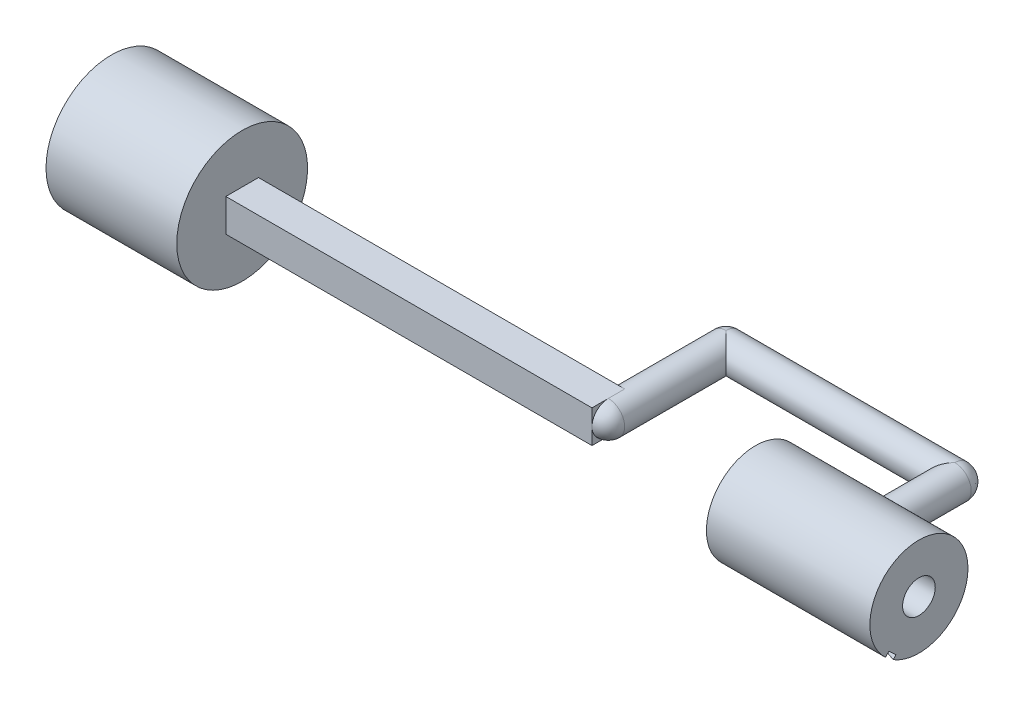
ISO-10303-21;
HEADER;
FILE_DESCRIPTION(('STEP AP214'),'2;1');
FILE_NAME('part.step','',(''),(''),'','','');
FILE_SCHEMA(('AUTOMOTIVE_DESIGN { 1 0 10303 214 1 1 1 1 }'));
ENDSEC;
DATA;
#1=APPLICATION_CONTEXT('core data for automotive mechanical design processes');
#2=APPLICATION_PROTOCOL_DEFINITION('international standard','automotive_design',2000,#1);
#3=PRODUCT_CONTEXT('',#1,'mechanical');
#4=PRODUCT('Part','Part','',(#3));
#5=PRODUCT_RELATED_PRODUCT_CATEGORY('part','',(#4));
#6=PRODUCT_DEFINITION_FORMATION('','',#4);
#7=PRODUCT_DEFINITION_CONTEXT('part definition',#1,'design');
#8=PRODUCT_DEFINITION('design','',#6,#7);
#9=PRODUCT_DEFINITION_SHAPE('','',#8);
#10=(LENGTH_UNIT() NAMED_UNIT(*) SI_UNIT(.MILLI.,.METRE.));
#11=(NAMED_UNIT(*) PLANE_ANGLE_UNIT() SI_UNIT($,.RADIAN.));
#12=(NAMED_UNIT(*) SI_UNIT($,.STERADIAN.) SOLID_ANGLE_UNIT());
#13=UNCERTAINTY_MEASURE_WITH_UNIT(LENGTH_MEASURE(1.E-05),#10,'distance_accuracy_value','');
#14=(GEOMETRIC_REPRESENTATION_CONTEXT(3) GLOBAL_UNCERTAINTY_ASSIGNED_CONTEXT((#13)) GLOBAL_UNIT_ASSIGNED_CONTEXT((#10,
#11,#12)) REPRESENTATION_CONTEXT('',''));
#15=CARTESIAN_POINT('',(0.,0.,0.));
#16=DIRECTION('',(0.,0.,1.));
#17=DIRECTION('',(1.,0.,0.));
#18=AXIS2_PLACEMENT_3D('',#15,#16,#17);
#19=CARTESIAN_POINT('',(12.5,0.,18.));
#20=DIRECTION('',(-1.,0.,0.));
#21=DIRECTION('',(0.,0.,1.));
#22=AXIS2_PLACEMENT_3D('',#19,#20,#21);
#23=CYLINDRICAL_SURFACE('',#22,7.5);
#24=CARTESIAN_POINT('',(-2.5,0.,10.5));
#25=CARTESIAN_POINT('',(-2.5000006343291,-0.136408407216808,10.4999996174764));
#26=CARTESIAN_POINT('',(-2.48879933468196,-0.272812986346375,10.5037557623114));
#27=CARTESIAN_POINT('',(-2.44442722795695,-0.541604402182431,10.518369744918));
#28=CARTESIAN_POINT('',(-2.41125414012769,-0.673990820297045,10.5292283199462));
#29=CARTESIAN_POINT('',(-2.32420189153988,-0.93083197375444,10.5568673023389));
#30=CARTESIAN_POINT('',(-2.27035734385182,-1.05529956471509,10.5736378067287));
#31=CARTESIAN_POINT('',(-2.14364706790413,-1.29343734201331,10.6113888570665));
#32=CARTESIAN_POINT('',(-2.0707775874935,-1.40710539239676,10.6323702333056));
#33=CARTESIAN_POINT('',(-1.90543548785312,-1.62435418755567,10.6771476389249));
#34=CARTESIAN_POINT('',(-1.81242191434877,-1.72750925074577,10.7010110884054));
#35=CARTESIAN_POINT('',(-1.61058211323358,-1.91708173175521,10.748492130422));
#36=CARTESIAN_POINT('',(-1.50175241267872,-2.00349546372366,10.7721096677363));
#37=CARTESIAN_POINT('',(-1.26753721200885,-2.15956235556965,10.8171666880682));
#38=CARTESIAN_POINT('',(-1.14176565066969,-2.22866214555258,10.8385240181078));
#39=CARTESIAN_POINT('',(-0.879559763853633,-2.3445471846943,10.875617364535));
#40=CARTESIAN_POINT('',(-0.74312870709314,-2.39133924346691,10.8913550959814));
#41=CARTESIAN_POINT('',(-0.468316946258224,-2.45968365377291,10.9147174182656));
#42=CARTESIAN_POINT('',(-0.330156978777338,-2.48203362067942,10.9225976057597));
#43=CARTESIAN_POINT('',(-0.0518406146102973,-2.50335280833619,10.9301085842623));
#44=CARTESIAN_POINT('',(0.0883151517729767,-2.5023292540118,10.9297419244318));
#45=CARTESIAN_POINT('',(0.359841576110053,-2.47754975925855,10.9210246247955));
#46=CARTESIAN_POINT('',(0.491321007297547,-2.45483478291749,10.9130396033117));
#47=CARTESIAN_POINT('',(0.748483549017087,-2.38901540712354,10.8905835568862));
#48=CARTESIAN_POINT('',(0.874165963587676,-2.34590856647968,10.8761117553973));
#49=CARTESIAN_POINT('',(1.1185318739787,-2.23984764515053,10.8420522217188));
#50=CARTESIAN_POINT('',(1.23707006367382,-2.17658512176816,10.8223858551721));
#51=CARTESIAN_POINT('',(1.46217727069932,-2.03222276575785,10.7801860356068));
#52=CARTESIAN_POINT('',(1.56874281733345,-1.95111778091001,10.7576517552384));
#53=CARTESIAN_POINT('',(1.77272899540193,-1.76837333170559,10.7108167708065));
#54=CARTESIAN_POINT('',(1.86938173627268,-1.66588287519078,10.6864852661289));
#55=CARTESIAN_POINT('',(2.0443281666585,-1.44584892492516,10.6398265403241));
#56=CARTESIAN_POINT('',(2.12262009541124,-1.32830398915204,10.6174995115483));
#57=CARTESIAN_POINT('',(2.25924075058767,-1.07986903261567,10.5770723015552));
#58=CARTESIAN_POINT('',(2.31736372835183,-0.94885819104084,10.559016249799));
#59=CARTESIAN_POINT('',(2.41050793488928,-0.678172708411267,10.5294858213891));
#60=CARTESIAN_POINT('',(2.44553718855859,-0.538501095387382,10.518009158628));
#61=CARTESIAN_POINT('',(2.4901391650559,-0.260959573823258,10.503309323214));
#62=CARTESIAN_POINT('',(2.50074952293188,-0.123273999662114,10.4997499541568));
#63=CARTESIAN_POINT('',(2.49916831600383,0.151937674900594,10.5002774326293));
#64=CARTESIAN_POINT('',(2.48698060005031,0.289463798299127,10.5043629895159));
#65=CARTESIAN_POINT('',(2.4409702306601,0.55629966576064,10.5194993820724));
#66=CARTESIAN_POINT('',(2.40778448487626,0.68573201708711,10.5303450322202));
#67=CARTESIAN_POINT('',(2.32151638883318,0.937139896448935,10.5577038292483));
#68=CARTESIAN_POINT('',(2.26843150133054,1.05911447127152,10.5742176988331));
#69=CARTESIAN_POINT('',(2.14232392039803,1.29572074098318,10.6117767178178));
#70=CARTESIAN_POINT('',(2.06881351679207,1.41007489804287,10.6329296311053));
#71=CARTESIAN_POINT('',(1.90451462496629,1.62516207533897,10.6773686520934));
#72=CARTESIAN_POINT('',(1.81372085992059,1.72589091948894,10.7006554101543));
#73=CARTESIAN_POINT('',(1.61255312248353,1.91563126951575,10.7480788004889));
#74=CARTESIAN_POINT('',(1.50147693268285,2.00390242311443,10.7722059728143));
#75=CARTESIAN_POINT('',(1.26557108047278,2.16064380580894,10.8175006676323));
#76=CARTESIAN_POINT('',(1.14074130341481,2.22911386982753,10.8386681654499));
#77=CARTESIAN_POINT('',(0.880817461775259,2.3439923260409,10.8754402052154));
#78=CARTESIAN_POINT('',(0.745744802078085,2.39044533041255,10.8910559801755));
#79=CARTESIAN_POINT('',(0.469053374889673,2.45973666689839,10.9147291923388));
#80=CARTESIAN_POINT('',(0.327437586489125,2.48258563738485,10.922790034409));
#81=CARTESIAN_POINT('',(0.0495072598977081,2.50319070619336,10.9300535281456));
#82=CARTESIAN_POINT('',(-0.0867058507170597,2.502175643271,10.9296899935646));
#83=CARTESIAN_POINT('',(-0.356912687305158,2.47810573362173,10.9212182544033));
#84=CARTESIAN_POINT('',(-0.490906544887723,2.45505219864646,10.913110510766));
#85=CARTESIAN_POINT('',(-0.750339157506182,2.38842953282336,10.8903868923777));
#86=CARTESIAN_POINT('',(-0.875892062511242,2.34525836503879,10.8758975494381));
#87=CARTESIAN_POINT('',(-1.11806851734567,2.23994841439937,10.8420900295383));
#88=CARTESIAN_POINT('',(-1.23469007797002,2.17780542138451,10.8227707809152));
#89=CARTESIAN_POINT('',(-1.46120917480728,2.03315173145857,10.7804292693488));
#90=CARTESIAN_POINT('',(-1.57059125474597,1.94987060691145,10.7572822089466));
#91=CARTESIAN_POINT('',(-1.7742245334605,1.76660720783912,10.7104160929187));
#92=CARTESIAN_POINT('',(-1.86847143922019,1.6666202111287,10.6866968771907));
#93=CARTESIAN_POINT('',(-2.04286103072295,1.44810389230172,10.6402492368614));
#94=CARTESIAN_POINT('',(-2.1223108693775,1.32900378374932,10.6175954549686));
#95=CARTESIAN_POINT('',(-2.25997607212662,1.07839339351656,10.5768502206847));
#96=CARTESIAN_POINT('',(-2.31819686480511,0.94688629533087,10.5587576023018));
#97=CARTESIAN_POINT('',(-2.40930408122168,0.681234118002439,10.5298621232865));
#98=CARTESIAN_POINT('',(-2.44320616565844,0.547469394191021,10.5187696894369));
#99=CARTESIAN_POINT('',(-2.48855070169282,0.275801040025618,10.5038398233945));
#100=CARTESIAN_POINT('',(-2.49999935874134,0.137898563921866,10.5000003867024));
#101=CARTESIAN_POINT('',(-2.5,0.,10.5));
#102=B_SPLINE_CURVE_WITH_KNOTS('',3,(#24,#25,#26,#27,#28,#29,#30,#31,#32,#33,#34,#35,#36,#37,
#38,#39,#40,#41,#42,#43,#44,#45,#46,#47,#48,#49,#50,#51,#52,#53,#54,#55,#56,#57,#58,#59,#60,#61,
#62,#63,#64,#65,#66,#67,#68,#69,#70,#71,#72,#73,#74,#75,#76,#77,#78,#79,#80,#81,#82,#83,#84,#85,
#86,#87,#88,#89,#90,#91,#92,#93,#94,#95,#96,#97,#98,#99,#100,#101),.UNSPECIFIED.,.T.,.F.,(4,2,2,
2,2,2,2,2,2,2,2,2,2,2,2,2,2,2,2,2,2,2,2,2,2,2,2,2,2,2,2,2,2,2,2,2,2,2,4),(0.,0.408717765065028,
0.817477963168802,1.22555668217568,1.63371594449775,2.0546171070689,2.47561083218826,
2.90870962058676,3.34167611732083,3.760048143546,4.17829084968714,4.57742066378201,
4.97659827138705,5.38220427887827,5.78792756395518,6.21483264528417,6.64177864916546,
7.07296014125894,7.50399172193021,7.91633957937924,8.32861782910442,8.72895394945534,
9.1293411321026,9.54025999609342,9.95130452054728,10.3810255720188,10.8107502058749,
11.2396003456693,11.668257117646,12.0748916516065,12.4815019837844,12.8803896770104,
13.2793659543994,13.6957516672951,14.1122552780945,14.5449915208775,14.9776170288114,
15.3909139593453,15.8040966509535),.UNSPECIFIED.);
#103=CARTESIAN_POINT('',(-2.5,0.,10.5));
#104=VERTEX_POINT('',#103);
#105=EDGE_CURVE('E145',#104,#104,#102,.T.);
#106=ORIENTED_EDGE('',*,*,#105,.T.);
#107=EDGE_LOOP('',(#106));
#108=FACE_BOUND('',#107,.T.);
#109=CARTESIAN_POINT('',(12.5,-5.48515276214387,23.1149877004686));
#110=CARTESIAN_POINT('',(9.67857142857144,-6.65261532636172,21.8630373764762));
#111=CARTESIAN_POINT('',(6.85714285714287,-7.16126186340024,20.228526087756));
#112=CARTESIAN_POINT('',(4.03571428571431,-7.66990840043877,18.5940147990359));
#113=CARTESIAN_POINT('',(1.21428571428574,-7.4189952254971,16.9006775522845));
#114=CARTESIAN_POINT('',(-1.60714285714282,-7.16808205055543,15.2073403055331));
#115=CARTESIAN_POINT('',(-4.42857142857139,-6.20730559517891,13.7905633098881));
#116=CARTESIAN_POINT('',(-7.24999999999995,-5.24652913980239,12.373786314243));
#117=CARTESIAN_POINT('',(-10.0714285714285,-3.76618296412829,11.5141796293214));
#118=CARTESIAN_POINT('',(-12.8928571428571,-2.28583678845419,10.6545729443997));
#119=CARTESIAN_POINT('',(-15.7142857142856,-0.579121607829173,10.5223922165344));
#120=CARTESIAN_POINT('',(-18.5357142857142,1.12759357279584,10.3902114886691));
#121=CARTESIAN_POINT('',(-21.3571428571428,2.72264188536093,11.011636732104));
#122=CARTESIAN_POINT('',(-24.1785714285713,4.31769019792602,11.6330619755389));
#123=CARTESIAN_POINT('',(-26.9999999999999,5.48515276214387,12.8850122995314));
#124=CARTESIAN_POINT('',(-29.8214285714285,6.65261532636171,14.1369626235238));
#125=CARTESIAN_POINT('',(-32.642857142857,7.16126186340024,15.771473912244));
#126=(BOUNDED_CURVE() B_SPLINE_CURVE(2,(#109,#110,#111,#112,#113,#114,#115,#116,#117,#118,#119,
#120,#121,#122,#123,#124,#125),.UNSPECIFIED.,.F.,.F.) B_SPLINE_CURVE_WITH_KNOTS((3,2,2,2,2,2,2,
2,3),(0.,0.125,0.25,0.375,0.5,0.625,0.75,0.875,1.),
.UNSPECIFIED.) CURVE() GEOMETRIC_REPRESENTATION_ITEM() RATIONAL_B_SPLINE_CURVE((1.,
0.974927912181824,1.,0.974927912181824,1.,0.974927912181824,1.,0.974927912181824,1.,
0.974927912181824,1.,0.974927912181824,1.,0.974927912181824,1.,0.974927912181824,1.)) REPRESENTATION_ITEM(''));
#127=CARTESIAN_POINT('',(12.5,-5.48515276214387,23.1149877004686));
#128=VERTEX_POINT('',#127);
#129=CARTESIAN_POINT('',(-12.5000173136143,-2.44928880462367,10.9112071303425));
#130=VERTEX_POINT('',#129);
#131=EDGE_CURVE('E52',#128,#130,#126,.T.);
#132=ORIENTED_EDGE('',*,*,#131,.F.);
#133=CARTESIAN_POINT('',(12.5,0.,18.));
#134=DIRECTION('',(1.,0.,0.));
#135=DIRECTION('',(0.,0.,-1.));
#136=AXIS2_PLACEMENT_3D('',#133,#134,#135);
#137=CIRCLE('',#136,7.5);
#138=CARTESIAN_POINT('',(12.5,-6.38825116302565,21.9294079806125));
#139=VERTEX_POINT('',#138);
#140=EDGE_CURVE('E135',#139,#128,#137,.T.);
#141=ORIENTED_EDGE('',*,*,#140,.F.);
#142=CARTESIAN_POINT('',(12.5,-6.38825116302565,21.9294079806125));
#143=CARTESIAN_POINT('',(9.67857142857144,-7.28511289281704,20.4713313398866));
#144=CARTESIAN_POINT('',(6.85714285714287,-7.46052164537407,18.7685159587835));
#145=CARTESIAN_POINT('',(4.03571428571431,-7.6359303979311,17.0657005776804));
#146=CARTESIAN_POINT('',(1.21428571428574,-7.05514431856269,15.4554099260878));
#147=CARTESIAN_POINT('',(-1.60714285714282,-6.47435823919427,13.8451192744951));
#148=CARTESIAN_POINT('',(-4.42857142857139,-5.25240913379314,12.6462911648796));
#149=CARTESIAN_POINT('',(-7.24999999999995,-4.03046002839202,11.4474630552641));
#150=CARTESIAN_POINT('',(-10.0714285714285,-2.40936990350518,10.897540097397));
#151=CARTESIAN_POINT('',(-12.8928571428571,-0.78827977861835,10.3476171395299));
#152=CARTESIAN_POINT('',(-15.7142857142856,0.91087458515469,10.5555183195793));
#153=CARTESIAN_POINT('',(-18.5357142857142,2.61002894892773,10.7634194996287));
#154=CARTESIAN_POINT('',(-21.3571428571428,4.050709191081,11.6879674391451));
#155=CARTESIAN_POINT('',(-24.1785714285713,5.49138943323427,12.6125153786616));
#156=CARTESIAN_POINT('',(-26.9999999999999,6.38825116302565,14.0705920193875));
#157=CARTESIAN_POINT('',(-29.8214285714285,7.28511289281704,15.5286686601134));
#158=CARTESIAN_POINT('',(-32.642857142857,7.46052164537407,17.2314840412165));
#159=(BOUNDED_CURVE() B_SPLINE_CURVE(2,(#142,#143,#144,#145,#146,#147,#148,#149,#150,#151,#152,
#153,#154,#155,#156,#157,#158),.UNSPECIFIED.,.F.,.F.) B_SPLINE_CURVE_WITH_KNOTS((3,2,2,2,2,2,2,
2,3),(0.,0.125,0.25,0.375,0.5,0.625,0.75,0.875,1.),
.UNSPECIFIED.) CURVE() GEOMETRIC_REPRESENTATION_ITEM() RATIONAL_B_SPLINE_CURVE((1.,
0.974927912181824,1.,0.974927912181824,1.,0.974927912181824,1.,0.974927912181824,1.,
0.974927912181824,1.,0.974927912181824,1.,0.974927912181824,1.,0.974927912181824,1.)) REPRESENTATION_ITEM(''));
#160=CARTESIAN_POINT('',(-12.5000000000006,-0.999303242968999,10.5668719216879));
#161=VERTEX_POINT('',#160);
#162=EDGE_CURVE('E138',#139,#161,#159,.T.);
#163=ORIENTED_EDGE('',*,*,#162,.T.);
#164=CARTESIAN_POINT('',(-12.5,0.,18.));
#165=DIRECTION('',(1.,0.,0.));
#166=DIRECTION('',(0.,0.,-1.));
#167=AXIS2_PLACEMENT_3D('',#164,#165,#166);
#168=CIRCLE('',#167,7.5);
#169=EDGE_CURVE('E137',#161,#130,#168,.T.);
#170=ORIENTED_EDGE('',*,*,#169,.T.);
#171=EDGE_LOOP('',(#132,#141,#163,#170));
#172=FACE_BOUND('',#171,.T.);
#173=ADVANCED_FACE('F32',(#108,#172),#23,.T.);
#174=CARTESIAN_POINT('',(-12.5,0.,18.));
#175=DIRECTION('',(1.,0.,0.));
#176=DIRECTION('',(0.,0.,-1.));
#177=AXIS2_PLACEMENT_3D('',#174,#175,#176);
#178=PLANE('',#177);
#179=CARTESIAN_POINT('',(-12.5,0.,18.));
#180=DIRECTION('',(1.,0.,0.));
#181=DIRECTION('',(0.,0.,-1.));
#182=AXIS2_PLACEMENT_3D('',#179,#180,#181);
#183=CIRCLE('',#182,2.5);
#184=CARTESIAN_POINT('',(-12.5,0.,15.5));
#185=VERTEX_POINT('',#184);
#186=EDGE_CURVE('E177',#185,#185,#183,.F.);
#187=ORIENTED_EDGE('',*,*,#186,.F.);
#188=EDGE_LOOP('',(#187));
#189=FACE_BOUND('',#188,.T.);
#190=CARTESIAN_POINT('',(-12.5,-0.799127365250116,11.1462123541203));
#191=CARTESIAN_POINT('',(-12.5,-0.816237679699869,11.0966924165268));
#192=CARTESIAN_POINT('',(-12.5,-0.833347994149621,11.0471724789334));
#193=CARTESIAN_POINT('',(-12.5,-0.867568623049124,10.9481326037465));
#194=CARTESIAN_POINT('',(-12.5,-0.884678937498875,10.898612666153));
#195=CARTESIAN_POINT('',(-12.5,-0.934293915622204,10.755019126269));
#196=CARTESIAN_POINT('',(-12.5,-0.966798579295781,10.6609455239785));
#197=CARTESIAN_POINT('',(-12.5,-0.999303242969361,10.566871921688));
#198=B_SPLINE_CURVE_WITH_KNOTS('',3,(#190,#191,#192,#193,#194,#195,#196,#197),.UNSPECIFIED.,.F.,
.F.,(4,2,2,4),(0.,0.157177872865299,0.314355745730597,0.612948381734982),.UNSPECIFIED.);
#199=CARTESIAN_POINT('',(-12.5,-0.799127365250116,11.1462123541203));
#200=VERTEX_POINT('',#199);
#201=EDGE_CURVE('E11',#200,#161,#198,.T.);
#202=ORIENTED_EDGE('',*,*,#201,.F.);
#203=CARTESIAN_POINT('',(-12.5,-2.20080480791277,11.6305251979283));
#204=CARTESIAN_POINT('',(-12.5,-2.08099445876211,11.5891278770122));
#205=CARTESIAN_POINT('',(-12.5,-1.96118410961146,11.5477305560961));
#206=CARTESIAN_POINT('',(-12.5,-1.72156341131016,11.4649359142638));
#207=CARTESIAN_POINT('',(-12.5,-1.6017530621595,11.4235385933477));
#208=CARTESIAN_POINT('',(-12.5,-1.25433759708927,11.3034982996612));
#209=CARTESIAN_POINT('',(-12.5,-1.0267324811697,11.2248553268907));
#210=CARTESIAN_POINT('',(-12.5,-0.799127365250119,11.1462123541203));
#211=B_SPLINE_CURVE_WITH_KNOTS('',3,(#203,#204,#205,#206,#207,#208,#209,#210),.UNSPECIFIED.,.F.,
.F.,(4,2,2,4),(0.,0.380281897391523,0.760563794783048,1.48298974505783),.UNSPECIFIED.);
#212=CARTESIAN_POINT('',(-12.5,-2.20080480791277,11.6305251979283));
#213=VERTEX_POINT('',#212);
#214=EDGE_CURVE('E44',#213,#200,#211,.T.);
#215=ORIENTED_EDGE('',*,*,#214,.F.);
#216=CARTESIAN_POINT('',(-12.5,-2.44934015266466,10.9112248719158));
#217=CARTESIAN_POINT('',(-12.5,-2.42809624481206,10.9727080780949));
#218=CARTESIAN_POINT('',(-12.5,-2.40685233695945,11.0341912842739));
#219=CARTESIAN_POINT('',(-12.5,-2.36436452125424,11.157157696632));
#220=CARTESIAN_POINT('',(-12.5,-2.34312061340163,11.218640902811));
#221=CARTESIAN_POINT('',(-12.5,-2.28151940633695,11.3969244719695));
#222=CARTESIAN_POINT('',(-12.5,-2.24116210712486,11.5137248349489));
#223=CARTESIAN_POINT('',(-12.5,-2.20080480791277,11.6305251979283));
#224=B_SPLINE_CURVE_WITH_KNOTS('',3,(#216,#217,#218,#219,#220,#221,#222,#223),.UNSPECIFIED.,.F.,
.F.,(4,2,2,4),(0.,0.195149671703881,0.390299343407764,0.761027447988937),.UNSPECIFIED.);
#225=EDGE_CURVE('E272',#130,#213,#224,.T.);
#226=ORIENTED_EDGE('',*,*,#225,.F.);
#227=ORIENTED_EDGE('',*,*,#169,.F.);
#228=EDGE_LOOP('',(#202,#215,#226,#227));
#229=FACE_BOUND('',#228,.T.);
#230=ADVANCED_FACE('F246',(#189,#229),#178,.F.);
#231=CARTESIAN_POINT('',(-35.,-2.5,15.5));
#232=DIRECTION('',(-1.,0.,0.));
#233=DIRECTION('',(0.,0.,1.));
#234=AXIS2_PLACEMENT_3D('',#231,#232,#233);
#235=PLANE('',#234);
#236=CARTESIAN_POINT('',(-35.,0.,18.));
#237=DIRECTION('',(-1.,0.,0.));
#238=DIRECTION('',(0.,0.,1.));
#239=AXIS2_PLACEMENT_3D('',#236,#237,#238);
#240=CIRCLE('',#239,2.5);
#241=CARTESIAN_POINT('',(-35.,0.,20.5));
#242=VERTEX_POINT('',#241);
#243=CARTESIAN_POINT('',(-35.,-2.5,18.));
#244=VERTEX_POINT('',#243);
#245=EDGE_CURVE('E368',#242,#244,#240,.F.);
#246=ORIENTED_EDGE('',*,*,#245,.F.);
#247=DIRECTION('',(0.,1.,0.));
#248=VECTOR('',#247,1.);
#249=CARTESIAN_POINT('',(-35.,2.5,20.5));
#250=LINE('',#249,#248);
#251=CARTESIAN_POINT('',(-35.,-2.5,20.5));
#252=VERTEX_POINT('',#251);
#253=EDGE_CURVE('E191',#252,#242,#250,.T.);
#254=ORIENTED_EDGE('',*,*,#253,.F.);
#255=DIRECTION('',(0.,0.,1.));
#256=VECTOR('',#255,1.);
#257=CARTESIAN_POINT('',(-35.,-2.5,15.5));
#258=LINE('',#257,#256);
#259=EDGE_CURVE('E188',#244,#252,#258,.T.);
#260=ORIENTED_EDGE('',*,*,#259,.F.);
#261=EDGE_LOOP('',(#246,#254,#260));
#262=FACE_BOUND('',#261,.T.);
#263=ADVANCED_FACE('F254',(#262),#235,.F.);
#264=CARTESIAN_POINT('',(-35.,2.5,18.));
#265=VERTEX_POINT('',#264);
#266=EDGE_CURVE('E366',#265,#242,#240,.F.);
#267=ORIENTED_EDGE('',*,*,#266,.F.);
#268=DIRECTION('',(0.,0.,-1.));
#269=VECTOR('',#268,1.);
#270=CARTESIAN_POINT('',(-35.,2.5,15.5));
#271=LINE('',#270,#269);
#272=CARTESIAN_POINT('',(-35.,2.5,20.5));
#273=VERTEX_POINT('',#272);
#274=EDGE_CURVE('E194',#273,#265,#271,.T.);
#275=ORIENTED_EDGE('',*,*,#274,.F.);
#276=EDGE_CURVE('E190',#242,#273,#250,.T.);
#277=ORIENTED_EDGE('',*,*,#276,.F.);
#278=EDGE_LOOP('',(#267,#275,#277));
#279=FACE_BOUND('',#278,.T.);
#280=ADVANCED_FACE('F335',(#279),#235,.F.);
#281=CARTESIAN_POINT('',(-35.,0.,18.));
#282=DIRECTION('',(0.,0.,-1.));
#283=DIRECTION('',(-1.,0.,0.));
#284=AXIS2_PLACEMENT_3D('',#281,#282,#283);
#285=CYLINDRICAL_SURFACE('',#284,2.5);
#286=CARTESIAN_POINT('',(-35.,0.,0.));
#287=DIRECTION('',(0.707106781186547,0.,-0.707106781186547));
#288=DIRECTION('',(0.707106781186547,0.,0.707106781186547));
#289=AXIS2_PLACEMENT_3D('',#286,#287,#288);
#290=ELLIPSE('',#289,3.53553390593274,2.5);
#291=CARTESIAN_POINT('',(-35.,2.5,0.));
#292=VERTEX_POINT('',#291);
#293=CARTESIAN_POINT('',(-35.,-2.5,0.));
#294=VERTEX_POINT('',#293);
#295=EDGE_CURVE('E226',#292,#294,#290,.T.);
#296=ORIENTED_EDGE('',*,*,#295,.F.);
#297=CARTESIAN_POINT('',(-35.,0.,0.));
#298=DIRECTION('',(0.,0.,1.));
#299=DIRECTION('',(1.,0.,0.));
#300=AXIS2_PLACEMENT_3D('',#297,#298,#299);
#301=CIRCLE('',#300,2.5);
#302=EDGE_CURVE('E220',#292,#294,#301,.T.);
#303=ORIENTED_EDGE('',*,*,#302,.T.);
#304=EDGE_LOOP('',(#296,#303));
#305=FACE_BOUND('',#304,.T.);
#306=CARTESIAN_POINT('',(-35.,2.5,15.5));
#307=VERTEX_POINT('',#306);
#308=EDGE_CURVE('E193',#265,#307,#271,.T.);
#309=ORIENTED_EDGE('',*,*,#308,.F.);
#310=CARTESIAN_POINT('',(-35.,0.,18.));
#311=DIRECTION('',(0.,0.,1.));
#312=DIRECTION('',(1.,0.,0.));
#313=AXIS2_PLACEMENT_3D('',#310,#311,#312);
#314=CIRCLE('',#313,2.5);
#315=EDGE_CURVE('E223',#244,#265,#314,.T.);
#316=ORIENTED_EDGE('',*,*,#315,.F.);
#317=CARTESIAN_POINT('',(-35.,-2.5,15.5));
#318=VERTEX_POINT('',#317);
#319=EDGE_CURVE('E60',#318,#244,#258,.T.);
#320=ORIENTED_EDGE('',*,*,#319,.F.);
#321=CARTESIAN_POINT('',(-35.,0.,15.5));
#322=DIRECTION('',(0.,0.,1.));
#323=DIRECTION('',(1.,0.,0.));
#324=AXIS2_PLACEMENT_3D('',#321,#322,#323);
#325=CIRCLE('',#324,2.5);
#326=EDGE_CURVE('E241',#307,#318,#325,.T.);
#327=ORIENTED_EDGE('',*,*,#326,.F.);
#328=EDGE_LOOP('',(#309,#316,#320,#327));
#329=FACE_BOUND('',#328,.T.);
#330=ADVANCED_FACE('F349',(#305,#329),#285,.T.);
#331=CARTESIAN_POINT('',(-35.,0.,0.));
#332=DIRECTION('',(1.,0.,0.));
#333=DIRECTION('',(0.,0.,-1.));
#334=AXIS2_PLACEMENT_3D('',#331,#332,#333);
#335=CYLINDRICAL_SURFACE('',#334,2.5);
#336=CARTESIAN_POINT('',(0.,0.,0.));
#337=DIRECTION('',(-0.707106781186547,0.,-0.707106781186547));
#338=DIRECTION('',(0.707106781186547,0.,-0.707106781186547));
#339=AXIS2_PLACEMENT_3D('',#336,#337,#338);
#340=ELLIPSE('',#339,3.53553390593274,2.5);
#341=CARTESIAN_POINT('',(0.,2.5,0.));
#342=VERTEX_POINT('',#341);
#343=CARTESIAN_POINT('',(0.,-2.5,0.));
#344=VERTEX_POINT('',#343);
#345=EDGE_CURVE('E147',#342,#344,#340,.F.);
#346=ORIENTED_EDGE('',*,*,#345,.F.);
#347=CARTESIAN_POINT('',(0.,0.,0.));
#348=DIRECTION('',(1.,0.,0.));
#349=DIRECTION('',(0.,0.,-1.));
#350=AXIS2_PLACEMENT_3D('',#347,#348,#349);
#351=CIRCLE('',#350,2.5);
#352=EDGE_CURVE('E229',#344,#342,#351,.T.);
#353=ORIENTED_EDGE('',*,*,#352,.F.);
#354=EDGE_LOOP('',(#346,#353));
#355=FACE_BOUND('',#354,.T.);
#356=CARTESIAN_POINT('',(-35.,0.,0.));
#357=DIRECTION('',(1.,0.,0.));
#358=DIRECTION('',(0.,0.,-1.));
#359=AXIS2_PLACEMENT_3D('',#356,#357,#358);
#360=CIRCLE('',#359,2.5);
#361=EDGE_CURVE('E232',#294,#292,#360,.T.);
#362=ORIENTED_EDGE('',*,*,#361,.T.);
#363=ORIENTED_EDGE('',*,*,#295,.T.);
#364=EDGE_LOOP('',(#362,#363));
#365=FACE_BOUND('',#364,.T.);
#366=ADVANCED_FACE('F256',(#355,#365),#335,.T.);
#367=CARTESIAN_POINT('',(0.,0.,18.));
#368=DIRECTION('',(0.,0.,-1.));
#369=DIRECTION('',(-1.,0.,0.));
#370=AXIS2_PLACEMENT_3D('',#367,#368,#369);
#371=CYLINDRICAL_SURFACE('',#370,2.5);
#372=CARTESIAN_POINT('',(0.,0.,0.));
#373=DIRECTION('',(0.,0.,1.));
#374=DIRECTION('',(1.,0.,0.));
#375=AXIS2_PLACEMENT_3D('',#372,#373,#374);
#376=CIRCLE('',#375,2.5);
#377=EDGE_CURVE('E143',#344,#342,#376,.T.);
#378=ORIENTED_EDGE('',*,*,#377,.T.);
#379=ORIENTED_EDGE('',*,*,#345,.T.);
#380=EDGE_LOOP('',(#378,#379));
#381=FACE_BOUND('',#380,.T.);
#382=ORIENTED_EDGE('',*,*,#105,.F.);
#383=EDGE_LOOP('',(#382));
#384=FACE_BOUND('',#383,.T.);
#385=ADVANCED_FACE('F34',(#381,#384),#371,.T.);
#386=CARTESIAN_POINT('',(12.5,0.,18.));
#387=DIRECTION('',(1.,0.,0.));
#388=DIRECTION('',(0.,0.,-1.));
#389=AXIS2_PLACEMENT_3D('',#386,#387,#388);
#390=PLANE('',#389);
#391=DIRECTION('',(0.,-0.731353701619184,0.681998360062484));
#392=VECTOR('',#391,1.);
#393=CARTESIAN_POINT('',(12.5,-5.48515276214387,23.1149877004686));
#394=LINE('',#393,#392);
#395=CARTESIAN_POINT('',(12.5,-4.92857252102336,22.5959682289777));
#396=VERTEX_POINT('',#395);
#397=EDGE_CURVE('E122',#396,#128,#394,.T.);
#398=ORIENTED_EDGE('',*,*,#397,.F.);
#399=DIRECTION('',(0.,0.681998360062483,0.731353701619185));
#400=VECTOR('',#399,1.);
#401=CARTESIAN_POINT('',(12.5,-4.92857252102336,22.5959682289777));
#402=LINE('',#401,#400);
#403=CARTESIAN_POINT('',(12.5,-5.93996909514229,21.5113781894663));
#404=VERTEX_POINT('',#403);
#405=EDGE_CURVE('E129',#404,#396,#402,.T.);
#406=ORIENTED_EDGE('',*,*,#405,.F.);
#407=DIRECTION('',(0.,0.731353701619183,-0.681998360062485));
#408=VECTOR('',#407,1.);
#409=CARTESIAN_POINT('',(12.5,-5.93996909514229,21.5113781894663));
#410=LINE('',#409,#408);
#411=EDGE_CURVE('E142',#139,#404,#410,.T.);
#412=ORIENTED_EDGE('',*,*,#411,.F.);
#413=ORIENTED_EDGE('',*,*,#140,.T.);
#414=EDGE_LOOP('',(#398,#406,#412,#413));
#415=FACE_BOUND('',#414,.T.);
#416=CARTESIAN_POINT('',(12.5,0.,18.));
#417=DIRECTION('',(1.,0.,0.));
#418=DIRECTION('',(0.,0.,-1.));
#419=AXIS2_PLACEMENT_3D('',#416,#417,#418);
#420=CIRCLE('',#419,2.5);
#421=CARTESIAN_POINT('',(12.5,0.,15.5));
#422=VERTEX_POINT('',#421);
#423=EDGE_CURVE('E169',#422,#422,#420,.T.);
#424=ORIENTED_EDGE('',*,*,#423,.F.);
#425=EDGE_LOOP('',(#424));
#426=FACE_BOUND('',#425,.T.);
#427=ADVANCED_FACE('F140',(#415,#426),#390,.T.);
#428=CARTESIAN_POINT('',(-91.,2.5,15.5));
#429=DIRECTION('',(0.,0.,1.));
#430=DIRECTION('',(1.,0.,0.));
#431=AXIS2_PLACEMENT_3D('',#428,#429,#430);
#432=PLANE('',#431);
#433=DIRECTION('',(1.,0.,0.));
#434=VECTOR('',#433,1.);
#435=CARTESIAN_POINT('',(-91.,2.5,15.5));
#436=LINE('',#435,#434);
#437=CARTESIAN_POINT('',(-91.,2.5,15.5));
#438=VERTEX_POINT('',#437);
#439=EDGE_CURVE('E209',#438,#307,#436,.T.);
#440=ORIENTED_EDGE('',*,*,#439,.T.);
#441=ORIENTED_EDGE('',*,*,#326,.T.);
#442=DIRECTION('',(1.,0.,0.));
#443=VECTOR('',#442,1.);
#444=CARTESIAN_POINT('',(-91.,-2.5,15.5));
#445=LINE('',#444,#443);
#446=CARTESIAN_POINT('',(-91.,-2.5,15.5));
#447=VERTEX_POINT('',#446);
#448=EDGE_CURVE('E218',#447,#318,#445,.T.);
#449=ORIENTED_EDGE('',*,*,#448,.F.);
#450=DIRECTION('',(0.,-1.,0.));
#451=VECTOR('',#450,1.);
#452=CARTESIAN_POINT('',(-91.,2.5,15.5));
#453=LINE('',#452,#451);
#454=EDGE_CURVE('E197',#438,#447,#453,.T.);
#455=ORIENTED_EDGE('',*,*,#454,.F.);
#456=EDGE_LOOP('',(#440,#441,#449,#455));
#457=FACE_BOUND('',#456,.T.);
#458=ADVANCED_FACE('F250',(#457),#432,.F.);
#459=CARTESIAN_POINT('',(-91.,-2.5,15.5));
#460=DIRECTION('',(0.,1.,0.));
#461=DIRECTION('',(0.,0.,1.));
#462=AXIS2_PLACEMENT_3D('',#459,#460,#461);
#463=PLANE('',#462);
#464=ORIENTED_EDGE('',*,*,#319,.T.);
#465=ORIENTED_EDGE('',*,*,#259,.T.);
#466=DIRECTION('',(1.,0.,0.));
#467=VECTOR('',#466,1.);
#468=CARTESIAN_POINT('',(-91.,-2.5,20.5));
#469=LINE('',#468,#467);
#470=CARTESIAN_POINT('',(-91.,-2.5,20.5));
#471=VERTEX_POINT('',#470);
#472=EDGE_CURVE('E215',#471,#252,#469,.T.);
#473=ORIENTED_EDGE('',*,*,#472,.F.);
#474=DIRECTION('',(0.,0.,1.));
#475=VECTOR('',#474,1.);
#476=CARTESIAN_POINT('',(-91.,-2.5,15.5));
#477=LINE('',#476,#475);
#478=EDGE_CURVE('E200',#447,#471,#477,.T.);
#479=ORIENTED_EDGE('',*,*,#478,.F.);
#480=ORIENTED_EDGE('',*,*,#448,.T.);
#481=EDGE_LOOP('',(#464,#465,#473,#479,#480));
#482=FACE_BOUND('',#481,.T.);
#483=ADVANCED_FACE('F343',(#482),#463,.F.);
#484=CARTESIAN_POINT('',(-91.,2.5,20.5));
#485=DIRECTION('',(0.,0.,-1.));
#486=DIRECTION('',(0.,1.,0.));
#487=AXIS2_PLACEMENT_3D('',#484,#485,#486);
#488=PLANE('',#487);
#489=ORIENTED_EDGE('',*,*,#253,.T.);
#490=ORIENTED_EDGE('',*,*,#276,.T.);
#491=DIRECTION('',(1.,0.,0.));
#492=VECTOR('',#491,1.);
#493=CARTESIAN_POINT('',(-91.,2.5,20.5));
#494=LINE('',#493,#492);
#495=CARTESIAN_POINT('',(-91.,2.5,20.5));
#496=VERTEX_POINT('',#495);
#497=EDGE_CURVE('E212',#496,#273,#494,.T.);
#498=ORIENTED_EDGE('',*,*,#497,.F.);
#499=DIRECTION('',(0.,1.,0.));
#500=VECTOR('',#499,1.);
#501=CARTESIAN_POINT('',(-91.,2.5,20.5));
#502=LINE('',#501,#500);
#503=EDGE_CURVE('E203',#471,#496,#502,.T.);
#504=ORIENTED_EDGE('',*,*,#503,.F.);
#505=ORIENTED_EDGE('',*,*,#472,.T.);
#506=EDGE_LOOP('',(#489,#490,#498,#504,#505));
#507=FACE_BOUND('',#506,.T.);
#508=ADVANCED_FACE('F339',(#507),#488,.F.);
#509=CARTESIAN_POINT('',(-91.,2.5,15.5));
#510=DIRECTION('',(0.,-1.,0.));
#511=DIRECTION('',(0.,0.,-1.));
#512=AXIS2_PLACEMENT_3D('',#509,#510,#511);
#513=PLANE('',#512);
#514=ORIENTED_EDGE('',*,*,#274,.T.);
#515=ORIENTED_EDGE('',*,*,#308,.T.);
#516=ORIENTED_EDGE('',*,*,#439,.F.);
#517=DIRECTION('',(0.,0.,-1.));
#518=VECTOR('',#517,1.);
#519=CARTESIAN_POINT('',(-91.,2.5,15.5));
#520=LINE('',#519,#518);
#521=EDGE_CURVE('E206',#496,#438,#520,.T.);
#522=ORIENTED_EDGE('',*,*,#521,.F.);
#523=ORIENTED_EDGE('',*,*,#497,.T.);
#524=EDGE_LOOP('',(#514,#515,#516,#522,#523));
#525=FACE_BOUND('',#524,.T.);
#526=ADVANCED_FACE('F325',(#525),#513,.F.);
#527=CARTESIAN_POINT('',(-91.,0.,18.));
#528=DIRECTION('',(-1.,0.,0.));
#529=DIRECTION('',(0.,0.,1.));
#530=AXIS2_PLACEMENT_3D('',#527,#528,#529);
#531=PLANE('',#530);
#532=CARTESIAN_POINT('',(-91.,0.,18.));
#533=DIRECTION('',(-1.,0.,0.));
#534=DIRECTION('',(0.,0.,1.));
#535=AXIS2_PLACEMENT_3D('',#532,#533,#534);
#536=CIRCLE('',#535,10.);
#537=CARTESIAN_POINT('',(-91.,0.,28.));
#538=VERTEX_POINT('',#537);
#539=EDGE_CURVE('E180',#538,#538,#536,.T.);
#540=ORIENTED_EDGE('',*,*,#539,.F.);
#541=EDGE_LOOP('',(#540));
#542=FACE_BOUND('',#541,.T.);
#543=ORIENTED_EDGE('',*,*,#521,.T.);
#544=ORIENTED_EDGE('',*,*,#454,.T.);
#545=ORIENTED_EDGE('',*,*,#478,.T.);
#546=ORIENTED_EDGE('',*,*,#503,.T.);
#547=EDGE_LOOP('',(#543,#544,#545,#546));
#548=FACE_BOUND('',#547,.T.);
#549=ADVANCED_FACE('F321',(#542,#548),#531,.F.);
#550=CARTESIAN_POINT('',(-111.,0.,18.));
#551=DIRECTION('',(1.,0.,0.));
#552=DIRECTION('',(0.,0.,-1.));
#553=AXIS2_PLACEMENT_3D('',#550,#551,#552);
#554=CYLINDRICAL_SURFACE('',#553,10.);
#555=CARTESIAN_POINT('',(-111.,0.,18.));
#556=DIRECTION('',(-1.,0.,0.));
#557=DIRECTION('',(0.,0.,1.));
#558=AXIS2_PLACEMENT_3D('',#555,#556,#557);
#559=CIRCLE('',#558,10.);
#560=CARTESIAN_POINT('',(-111.,0.,28.));
#561=VERTEX_POINT('',#560);
#562=EDGE_CURVE('E185',#561,#561,#559,.T.);
#563=ORIENTED_EDGE('',*,*,#562,.F.);
#564=EDGE_LOOP('',(#563));
#565=FACE_BOUND('',#564,.T.);
#566=ORIENTED_EDGE('',*,*,#539,.T.);
#567=EDGE_LOOP('',(#566));
#568=FACE_BOUND('',#567,.T.);
#569=ADVANCED_FACE('F324',(#565,#568),#554,.T.);
#570=CARTESIAN_POINT('',(-111.,0.,18.));
#571=DIRECTION('',(-1.,0.,0.));
#572=DIRECTION('',(0.,0.,1.));
#573=AXIS2_PLACEMENT_3D('',#570,#571,#572);
#574=PLANE('',#573);
#575=ORIENTED_EDGE('',*,*,#562,.T.);
#576=EDGE_LOOP('',(#575));
#577=FACE_BOUND('',#576,.T.);
#578=ADVANCED_FACE('F319',(#577),#574,.T.);
#579=CARTESIAN_POINT('',(-111.001,0.,18.));
#580=DIRECTION('',(1.,0.,0.));
#581=DIRECTION('',(0.,0.,-1.));
#582=AXIS2_PLACEMENT_3D('',#579,#580,#581);
#583=CYLINDRICAL_SURFACE('',#582,2.5);
#584=ORIENTED_EDGE('',*,*,#423,.T.);
#585=EDGE_LOOP('',(#584));
#586=FACE_BOUND('',#585,.T.);
#587=ORIENTED_EDGE('',*,*,#186,.T.);
#588=EDGE_LOOP('',(#587));
#589=FACE_BOUND('',#588,.T.);
#590=ADVANCED_FACE('F315',(#586,#589),#583,.F.);
#591=CARTESIAN_POINT('',(-35.,0.,18.));
#592=DIRECTION('',(0.,1.,0.));
#593=DIRECTION('',(1.,0.,0.));
#594=AXIS2_PLACEMENT_3D('',#591,#592,#593);
#595=SPHERICAL_SURFACE('',#594,2.5);
#596=ORIENTED_EDGE('',*,*,#315,.T.);
#597=ORIENTED_EDGE('',*,*,#266,.T.);
#598=ORIENTED_EDGE('',*,*,#245,.T.);
#599=EDGE_LOOP('',(#596,#597,#598));
#600=FACE_BOUND('',#599,.T.);
#601=ADVANCED_FACE('F311',(#600),#595,.T.);
#602=CARTESIAN_POINT('',(-35.,0.,0.));
#603=DIRECTION('',(0.,-1.,0.));
#604=DIRECTION('',(0.,0.,-1.));
#605=AXIS2_PLACEMENT_3D('',#602,#603,#604);
#606=SPHERICAL_SURFACE('',#605,2.5);
#607=ORIENTED_EDGE('',*,*,#302,.F.);
#608=ORIENTED_EDGE('',*,*,#361,.F.);
#609=EDGE_LOOP('',(#607,#608));
#610=FACE_BOUND('',#609,.T.);
#611=ADVANCED_FACE('F307',(#610),#606,.T.);
#612=CARTESIAN_POINT('',(0.,0.,0.));
#613=DIRECTION('',(0.,-1.,0.));
#614=DIRECTION('',(0.,0.,1.));
#615=AXIS2_PLACEMENT_3D('',#612,#613,#614);
#616=SPHERICAL_SURFACE('',#615,2.5);
#617=ORIENTED_EDGE('',*,*,#377,.F.);
#618=ORIENTED_EDGE('',*,*,#352,.T.);
#619=EDGE_LOOP('',(#617,#618));
#620=FACE_BOUND('',#619,.T.);
#621=ADVANCED_FACE('F298',(#620),#616,.T.);
#622=CARTESIAN_POINT('',(12.5,-6.38825116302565,21.9294079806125));
#623=CARTESIAN_POINT('',(9.67857142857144,-7.28511289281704,20.4713313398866));
#624=CARTESIAN_POINT('',(6.85714285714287,-7.46052164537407,18.7685159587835));
#625=CARTESIAN_POINT('',(4.03571428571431,-7.6359303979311,17.0657005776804));
#626=CARTESIAN_POINT('',(1.21428571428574,-7.05514431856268,15.4554099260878));
#627=CARTESIAN_POINT('',(-1.60714285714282,-6.47435823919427,13.8451192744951));
#628=CARTESIAN_POINT('',(-4.42857142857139,-5.25240913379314,12.6462911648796));
#629=CARTESIAN_POINT('',(-7.24999999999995,-4.03046002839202,11.4474630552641));
#630=CARTESIAN_POINT('',(-10.0714285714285,-2.40936990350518,10.897540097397));
#631=CARTESIAN_POINT('',(-12.8928571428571,-0.788279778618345,10.3476171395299));
#632=CARTESIAN_POINT('',(-15.7142857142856,0.910874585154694,10.5555183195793));
#633=CARTESIAN_POINT('',(-18.5357142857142,2.61002894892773,10.7634194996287));
#634=CARTESIAN_POINT('',(-21.3571428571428,4.050709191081,11.6879674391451));
#635=CARTESIAN_POINT('',(-24.1785714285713,5.49138943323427,12.6125153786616));
#636=CARTESIAN_POINT('',(-26.9999999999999,6.38825116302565,14.0705920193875));
#637=CARTESIAN_POINT('',(-29.8214285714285,7.28511289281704,15.5286686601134));
#638=CARTESIAN_POINT('',(-32.642857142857,7.46052164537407,17.2314840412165));
#639=CARTESIAN_POINT('',(12.5,-5.93996909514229,21.5113781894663));
#640=CARTESIAN_POINT('',(9.67857142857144,-6.74141825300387,20.1556190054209));
#641=CARTESIAN_POINT('',(6.85714285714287,-6.87525712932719,18.5863864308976));
#642=CARTESIAN_POINT('',(4.03571428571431,-7.0090960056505,17.0171538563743));
#643=CARTESIAN_POINT('',(1.21428571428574,-6.44881616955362,15.5452536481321));
#644=CARTESIAN_POINT('',(-1.60714285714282,-5.88853633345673,14.0733534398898));
#645=CARTESIAN_POINT('',(-4.42857142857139,-4.74510807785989,12.9903134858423));
#646=CARTESIAN_POINT('',(-7.24999999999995,-3.60167982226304,11.9072735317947));
#647=CARTESIAN_POINT('',(-10.0714285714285,-2.10157313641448,11.4276031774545));
#648=CARTESIAN_POINT('',(-12.8928571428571,-0.601466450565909,10.9479328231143));
#649=CARTESIAN_POINT('',(-15.7142857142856,0.958204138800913,11.1666366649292));
#650=CARTESIAN_POINT('',(-18.5357142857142,2.51787472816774,11.3853405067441));
#651=CARTESIAN_POINT('',(-21.3571428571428,3.82819733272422,12.2591015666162));
#652=CARTESIAN_POINT('',(-24.1785714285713,5.1385199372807,13.1328626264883));
#653=CARTESIAN_POINT('',(-26.9999999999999,5.93996909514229,14.4886218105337));
#654=CARTESIAN_POINT('',(-29.8214285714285,6.74141825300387,15.8443809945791));
#655=CARTESIAN_POINT('',(-32.642857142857,6.87525712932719,17.4136135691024));
#656=(BOUNDED_SURFACE() B_SPLINE_SURFACE(1,2,((#622,#623,#624,#625,#626,#627,#628,#629,#630,
#631,#632,#633,#634,#635,#636,#637,#638),(#639,#640,#641,#642,#643,#644,#645,#646,#647,#648,
#649,#650,#651,#652,#653,#654,#655)),.UNSPECIFIED.,.F.,.F.,.F.) B_SPLINE_SURFACE_WITH_KNOTS((2,
2),(3,2,2,2,2,2,2,2,3),(0.,1.),(0.,0.125,0.25,0.375,0.5,0.625,0.75,0.875,1.),
.UNSPECIFIED.) GEOMETRIC_REPRESENTATION_ITEM() RATIONAL_B_SPLINE_SURFACE(((1.,0.974927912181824,
1.,0.974927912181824,1.,0.974927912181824,1.,0.974927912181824,1.,0.974927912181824,1.,
0.974927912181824,1.,0.974927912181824,1.,0.974927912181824,1.),(1.,0.974927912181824,1.,
0.974927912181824,1.,0.974927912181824,1.,0.974927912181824,1.,0.974927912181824,1.,
0.974927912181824,1.,0.974927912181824,1.,0.974927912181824,1.))) REPRESENTATION_ITEM('') SURFACE());
#657=CARTESIAN_POINT('',(12.5,-5.93996909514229,21.5113781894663));
#658=CARTESIAN_POINT('',(9.67857142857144,-6.74141825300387,20.1556190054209));
#659=CARTESIAN_POINT('',(6.85714285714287,-6.87525712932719,18.5863864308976));
#660=CARTESIAN_POINT('',(4.03571428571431,-7.0090960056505,17.0171538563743));
#661=CARTESIAN_POINT('',(1.21428571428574,-6.44881616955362,15.5452536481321));
#662=CARTESIAN_POINT('',(-1.60714285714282,-5.88853633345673,14.0733534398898));
#663=CARTESIAN_POINT('',(-4.42857142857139,-4.74510807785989,12.9903134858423));
#664=CARTESIAN_POINT('',(-7.24999999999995,-3.60167982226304,11.9072735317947));
#665=CARTESIAN_POINT('',(-10.0714285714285,-2.10157313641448,11.4276031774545));
#666=CARTESIAN_POINT('',(-12.8928571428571,-0.601466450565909,10.9479328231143));
#667=CARTESIAN_POINT('',(-15.7142857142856,0.958204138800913,11.1666366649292));
#668=CARTESIAN_POINT('',(-18.5357142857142,2.51787472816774,11.3853405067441));
#669=CARTESIAN_POINT('',(-21.3571428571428,3.82819733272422,12.2591015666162));
#670=CARTESIAN_POINT('',(-24.1785714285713,5.1385199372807,13.1328626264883));
#671=CARTESIAN_POINT('',(-26.9999999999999,5.93996909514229,14.4886218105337));
#672=CARTESIAN_POINT('',(-29.8214285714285,6.74141825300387,15.8443809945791));
#673=CARTESIAN_POINT('',(-32.642857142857,6.87525712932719,17.4136135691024));
#674=(BOUNDED_CURVE() B_SPLINE_CURVE(2,(#657,#658,#659,#660,#661,#662,#663,#664,#665,#666,#667,
#668,#669,#670,#671,#672,#673),.UNSPECIFIED.,.F.,.F.) B_SPLINE_CURVE_WITH_KNOTS((3,2,2,2,2,2,2,
2,3),(0.,0.125,0.25,0.375,0.5,0.625,0.75,0.875,1.),
.UNSPECIFIED.) CURVE() GEOMETRIC_REPRESENTATION_ITEM() RATIONAL_B_SPLINE_CURVE((1.,
0.974927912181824,1.,0.974927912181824,1.,0.974927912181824,1.,0.974927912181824,1.,
0.974927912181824,1.,0.974927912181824,1.,0.974927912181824,1.,0.974927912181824,1.)) REPRESENTATION_ITEM(''));
#675=EDGE_CURVE('E157',#404,#200,#674,.T.);
#676=ORIENTED_EDGE('',*,*,#201,.T.);
#677=ORIENTED_EDGE('',*,*,#162,.F.);
#678=ORIENTED_EDGE('',*,*,#411,.T.);
#679=ORIENTED_EDGE('',*,*,#675,.T.);
#680=EDGE_LOOP('',(#676,#677,#678,#679));
#681=FACE_BOUND('',#680,.T.);
#682=ADVANCED_FACE('F282',(#681),#656,.T.);
#683=CARTESIAN_POINT('',(12.5,-5.93996909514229,21.5113781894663));
#684=CARTESIAN_POINT('',(9.67857142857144,-6.74141825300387,20.1556190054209));
#685=CARTESIAN_POINT('',(6.85714285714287,-6.87525712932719,18.5863864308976));
#686=CARTESIAN_POINT('',(4.03571428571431,-7.0090960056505,17.0171538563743));
#687=CARTESIAN_POINT('',(1.21428571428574,-6.44881616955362,15.5452536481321));
#688=CARTESIAN_POINT('',(-1.60714285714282,-5.88853633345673,14.0733534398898));
#689=CARTESIAN_POINT('',(-4.42857142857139,-4.74510807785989,12.9903134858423));
#690=CARTESIAN_POINT('',(-7.24999999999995,-3.60167982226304,11.9072735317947));
#691=CARTESIAN_POINT('',(-10.0714285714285,-2.10157313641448,11.4276031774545));
#692=CARTESIAN_POINT('',(-12.8928571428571,-0.601466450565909,10.9479328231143));
#693=CARTESIAN_POINT('',(-15.7142857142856,0.958204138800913,11.1666366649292));
#694=CARTESIAN_POINT('',(-18.5357142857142,2.51787472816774,11.3853405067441));
#695=CARTESIAN_POINT('',(-21.3571428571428,3.82819733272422,12.2591015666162));
#696=CARTESIAN_POINT('',(-24.1785714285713,5.1385199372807,13.1328626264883));
#697=CARTESIAN_POINT('',(-26.9999999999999,5.93996909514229,14.4886218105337));
#698=CARTESIAN_POINT('',(-29.8214285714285,6.74141825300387,15.8443809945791));
#699=CARTESIAN_POINT('',(-32.642857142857,6.87525712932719,17.4136135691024));
#700=CARTESIAN_POINT('',(12.5,-4.92857252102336,22.5959682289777));
#701=CARTESIAN_POINT('',(9.67857142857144,-5.97757227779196,21.4710537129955));
#702=CARTESIAN_POINT('',(6.85714285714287,-6.43460628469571,20.0023968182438));
#703=CARTESIAN_POINT('',(4.03571428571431,-6.89164029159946,18.5337399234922));
#704=CARTESIAN_POINT('',(1.21428571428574,-6.66618735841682,17.0122261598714));
#705=CARTESIAN_POINT('',(-1.60714285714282,-6.44073442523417,15.4907123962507));
#706=CARTESIAN_POINT('',(-4.42857142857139,-5.57744827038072,14.2176962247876));
#707=CARTESIAN_POINT('',(-7.24999999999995,-4.71416211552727,12.9446800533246));
#708=CARTESIAN_POINT('',(-10.0714285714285,-3.38402714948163,12.1722979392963));
#709=CARTESIAN_POINT('',(-12.8928571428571,-2.05389218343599,11.399915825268));
#710=CARTESIAN_POINT('',(-15.7142857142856,-0.520357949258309,11.2811475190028));
#711=CARTESIAN_POINT('',(-18.5357142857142,1.01317628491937,11.1623792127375));
#712=CARTESIAN_POINT('',(-21.3571428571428,2.44637452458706,11.7207482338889));
#713=CARTESIAN_POINT('',(-24.1785714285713,3.87957276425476,12.2791172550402));
#714=CARTESIAN_POINT('',(-26.9999999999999,4.92857252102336,13.4040317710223));
#715=CARTESIAN_POINT('',(-29.8214285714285,5.97757227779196,14.5289462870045));
#716=CARTESIAN_POINT('',(-32.642857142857,6.43460628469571,15.9976031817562));
#717=(BOUNDED_SURFACE() B_SPLINE_SURFACE(1,2,((#683,#684,#685,#686,#687,#688,#689,#690,#691,
#692,#693,#694,#695,#696,#697,#698,#699),(#700,#701,#702,#703,#704,#705,#706,#707,#708,#709,
#710,#711,#712,#713,#714,#715,#716)),.UNSPECIFIED.,.F.,.F.,.F.) B_SPLINE_SURFACE_WITH_KNOTS((2,
2),(3,2,2,2,2,2,2,2,3),(0.,1.),(0.,0.125,0.25,0.375,0.5,0.625,0.75,0.875,1.),
.UNSPECIFIED.) GEOMETRIC_REPRESENTATION_ITEM() RATIONAL_B_SPLINE_SURFACE(((1.,0.974927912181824,
1.,0.974927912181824,1.,0.974927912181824,1.,0.974927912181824,1.,0.974927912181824,1.,
0.974927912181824,1.,0.974927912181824,1.,0.974927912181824,1.),(1.,0.974927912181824,1.,
0.974927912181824,1.,0.974927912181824,1.,0.974927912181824,1.,0.974927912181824,1.,
0.974927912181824,1.,0.974927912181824,1.,0.974927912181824,1.))) REPRESENTATION_ITEM('') SURFACE());
#718=CARTESIAN_POINT('',(12.5,-4.92857252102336,22.5959682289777));
#719=CARTESIAN_POINT('',(9.67857142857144,-5.97757227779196,21.4710537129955));
#720=CARTESIAN_POINT('',(6.85714285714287,-6.43460628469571,20.0023968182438));
#721=CARTESIAN_POINT('',(4.03571428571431,-6.89164029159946,18.5337399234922));
#722=CARTESIAN_POINT('',(1.21428571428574,-6.66618735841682,17.0122261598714));
#723=CARTESIAN_POINT('',(-1.60714285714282,-6.44073442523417,15.4907123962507));
#724=CARTESIAN_POINT('',(-4.42857142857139,-5.57744827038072,14.2176962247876));
#725=CARTESIAN_POINT('',(-7.24999999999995,-4.71416211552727,12.9446800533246));
#726=CARTESIAN_POINT('',(-10.0714285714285,-3.38402714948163,12.1722979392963));
#727=CARTESIAN_POINT('',(-12.8928571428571,-2.05389218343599,11.399915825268));
#728=CARTESIAN_POINT('',(-15.7142857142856,-0.520357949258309,11.2811475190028));
#729=CARTESIAN_POINT('',(-18.5357142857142,1.01317628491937,11.1623792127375));
#730=CARTESIAN_POINT('',(-21.3571428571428,2.44637452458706,11.7207482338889));
#731=CARTESIAN_POINT('',(-24.1785714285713,3.87957276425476,12.2791172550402));
#732=CARTESIAN_POINT('',(-26.9999999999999,4.92857252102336,13.4040317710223));
#733=CARTESIAN_POINT('',(-29.8214285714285,5.97757227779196,14.5289462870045));
#734=CARTESIAN_POINT('',(-32.642857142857,6.43460628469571,15.9976031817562));
#735=(BOUNDED_CURVE() B_SPLINE_CURVE(2,(#718,#719,#720,#721,#722,#723,#724,#725,#726,#727,#728,
#729,#730,#731,#732,#733,#734),.UNSPECIFIED.,.F.,.F.) B_SPLINE_CURVE_WITH_KNOTS((3,2,2,2,2,2,2,
2,3),(0.,0.125,0.25,0.375,0.5,0.625,0.75,0.875,1.),
.UNSPECIFIED.) CURVE() GEOMETRIC_REPRESENTATION_ITEM() RATIONAL_B_SPLINE_CURVE((1.,
0.974927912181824,1.,0.974927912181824,1.,0.974927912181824,1.,0.974927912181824,1.,
0.974927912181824,1.,0.974927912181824,1.,0.974927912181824,1.,0.974927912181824,1.)) REPRESENTATION_ITEM(''));
#736=EDGE_CURVE('E125',#396,#213,#735,.T.);
#737=ORIENTED_EDGE('',*,*,#214,.T.);
#738=ORIENTED_EDGE('',*,*,#675,.F.);
#739=ORIENTED_EDGE('',*,*,#405,.T.);
#740=ORIENTED_EDGE('',*,*,#736,.T.);
#741=EDGE_LOOP('',(#737,#738,#739,#740));
#742=FACE_BOUND('',#741,.T.);
#743=ADVANCED_FACE('F277',(#742),#717,.T.);
#744=CARTESIAN_POINT('',(12.5,-4.92857252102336,22.5959682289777));
#745=CARTESIAN_POINT('',(9.67857142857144,-5.97757227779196,21.4710537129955));
#746=CARTESIAN_POINT('',(6.85714285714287,-6.43460628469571,20.0023968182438));
#747=CARTESIAN_POINT('',(4.03571428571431,-6.89164029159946,18.5337399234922));
#748=CARTESIAN_POINT('',(1.21428571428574,-6.66618735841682,17.0122261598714));
#749=CARTESIAN_POINT('',(-1.60714285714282,-6.44073442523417,15.4907123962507));
#750=CARTESIAN_POINT('',(-4.42857142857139,-5.57744827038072,14.2176962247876));
#751=CARTESIAN_POINT('',(-7.24999999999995,-4.71416211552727,12.9446800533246));
#752=CARTESIAN_POINT('',(-10.0714285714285,-3.38402714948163,12.1722979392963));
#753=CARTESIAN_POINT('',(-12.8928571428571,-2.05389218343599,11.399915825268));
#754=CARTESIAN_POINT('',(-15.7142857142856,-0.520357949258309,11.2811475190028));
#755=CARTESIAN_POINT('',(-18.5357142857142,1.01317628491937,11.1623792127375));
#756=CARTESIAN_POINT('',(-21.3571428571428,2.44637452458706,11.7207482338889));
#757=CARTESIAN_POINT('',(-24.1785714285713,3.87957276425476,12.2791172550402));
#758=CARTESIAN_POINT('',(-26.9999999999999,4.92857252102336,13.4040317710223));
#759=CARTESIAN_POINT('',(-29.8214285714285,5.97757227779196,14.5289462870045));
#760=CARTESIAN_POINT('',(-32.642857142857,6.43460628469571,15.9976031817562));
#761=CARTESIAN_POINT('',(12.5,-5.48515276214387,23.1149877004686));
#762=CARTESIAN_POINT('',(9.67857142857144,-6.65261532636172,21.8630373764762));
#763=CARTESIAN_POINT('',(6.85714285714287,-7.16126186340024,20.228526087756));
#764=CARTESIAN_POINT('',(4.03571428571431,-7.66990840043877,18.5940147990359));
#765=CARTESIAN_POINT('',(1.21428571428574,-7.4189952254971,16.9006775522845));
#766=CARTESIAN_POINT('',(-1.60714285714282,-7.16808205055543,15.2073403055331));
#767=CARTESIAN_POINT('',(-4.42857142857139,-6.20730559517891,13.7905633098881));
#768=CARTESIAN_POINT('',(-7.24999999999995,-5.24652913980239,12.373786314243));
#769=CARTESIAN_POINT('',(-10.0714285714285,-3.76618296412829,11.5141796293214));
#770=CARTESIAN_POINT('',(-12.8928571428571,-2.28583678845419,10.6545729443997));
#771=CARTESIAN_POINT('',(-15.7142857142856,-0.579121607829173,10.5223922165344));
#772=CARTESIAN_POINT('',(-18.5357142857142,1.12759357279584,10.3902114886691));
#773=CARTESIAN_POINT('',(-21.3571428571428,2.72264188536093,11.011636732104));
#774=CARTESIAN_POINT('',(-24.1785714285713,4.31769019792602,11.6330619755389));
#775=CARTESIAN_POINT('',(-26.9999999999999,5.48515276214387,12.8850122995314));
#776=CARTESIAN_POINT('',(-29.8214285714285,6.65261532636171,14.1369626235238));
#777=CARTESIAN_POINT('',(-32.642857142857,7.16126186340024,15.771473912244));
#778=(BOUNDED_SURFACE() B_SPLINE_SURFACE(1,2,((#744,#745,#746,#747,#748,#749,#750,#751,#752,
#753,#754,#755,#756,#757,#758,#759,#760),(#761,#762,#763,#764,#765,#766,#767,#768,#769,#770,
#771,#772,#773,#774,#775,#776,#777)),.UNSPECIFIED.,.F.,.F.,.F.) B_SPLINE_SURFACE_WITH_KNOTS((2,
2),(3,2,2,2,2,2,2,2,3),(0.,1.),(0.,0.125,0.25,0.375,0.5,0.625,0.75,0.875,1.),
.UNSPECIFIED.) GEOMETRIC_REPRESENTATION_ITEM() RATIONAL_B_SPLINE_SURFACE(((1.,0.974927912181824,
1.,0.974927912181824,1.,0.974927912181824,1.,0.974927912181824,1.,0.974927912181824,1.,
0.974927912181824,1.,0.974927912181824,1.,0.974927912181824,1.),(1.,0.974927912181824,1.,
0.974927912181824,1.,0.974927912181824,1.,0.974927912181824,1.,0.974927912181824,1.,
0.974927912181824,1.,0.974927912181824,1.,0.974927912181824,1.))) REPRESENTATION_ITEM('') SURFACE());
#779=ORIENTED_EDGE('',*,*,#225,.T.);
#780=ORIENTED_EDGE('',*,*,#736,.F.);
#781=ORIENTED_EDGE('',*,*,#397,.T.);
#782=ORIENTED_EDGE('',*,*,#131,.T.);
#783=EDGE_LOOP('',(#779,#780,#781,#782));
#784=FACE_BOUND('',#783,.T.);
#785=ADVANCED_FACE('F123',(#784),#778,.T.);
#786=CLOSED_SHELL('',(#173,#230,#263,#280,#330,#366,#385,#427,#458,#483,#508,#526,#549,#569,
#578,#590,#601,#611,#621,#682,#743,#785));
#787=MANIFOLD_SOLID_BREP('B2',#786);
#788=ADVANCED_BREP_SHAPE_REPRESENTATION('',(#18,#787),#14);
#789=SHAPE_DEFINITION_REPRESENTATION(#9,#788);
ENDSEC;
END-ISO-10303-21;
